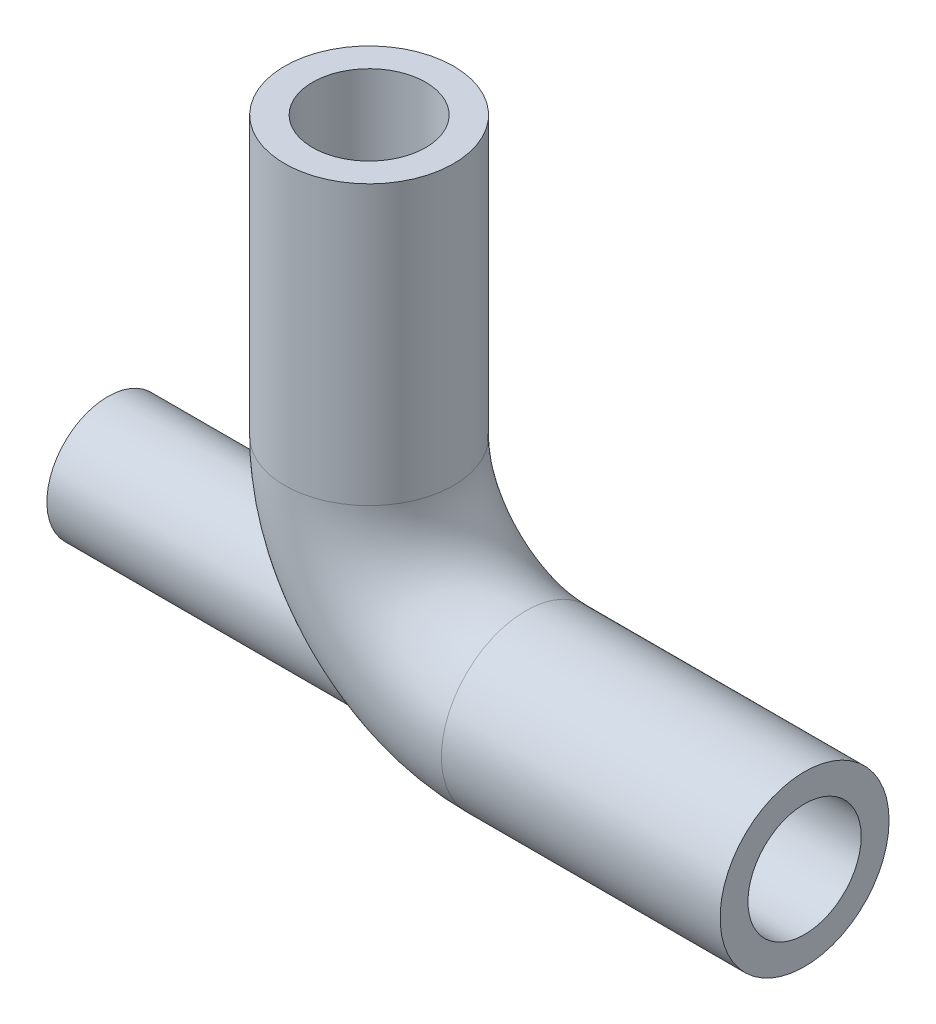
ISO-10303-21;
HEADER;
FILE_DESCRIPTION(('STEP AP214'),'2;1');
FILE_NAME('part.step','',(''),(''),'','','');
FILE_SCHEMA(('AUTOMOTIVE_DESIGN { 1 0 10303 214 1 1 1 1 }'));
ENDSEC;
DATA;
#1=APPLICATION_CONTEXT('core data for automotive mechanical design processes');
#2=APPLICATION_PROTOCOL_DEFINITION('international standard','automotive_design',2000,#1);
#3=PRODUCT_CONTEXT('',#1,'mechanical');
#4=PRODUCT('Part','Part','',(#3));
#5=PRODUCT_RELATED_PRODUCT_CATEGORY('part','',(#4));
#6=PRODUCT_DEFINITION_FORMATION('','',#4);
#7=PRODUCT_DEFINITION_CONTEXT('part definition',#1,'design');
#8=PRODUCT_DEFINITION('design','',#6,#7);
#9=PRODUCT_DEFINITION_SHAPE('','',#8);
#10=(LENGTH_UNIT() NAMED_UNIT(*) SI_UNIT(.MILLI.,.METRE.));
#11=(NAMED_UNIT(*) PLANE_ANGLE_UNIT() SI_UNIT($,.RADIAN.));
#12=(NAMED_UNIT(*) SI_UNIT($,.STERADIAN.) SOLID_ANGLE_UNIT());
#13=UNCERTAINTY_MEASURE_WITH_UNIT(LENGTH_MEASURE(1.E-05),#10,'distance_accuracy_value','');
#14=(GEOMETRIC_REPRESENTATION_CONTEXT(3) GLOBAL_UNCERTAINTY_ASSIGNED_CONTEXT((#13)) GLOBAL_UNIT_ASSIGNED_CONTEXT((#10,
#11,#12)) REPRESENTATION_CONTEXT('',''));
#15=CARTESIAN_POINT('',(0.,0.,0.));
#16=DIRECTION('',(0.,0.,1.));
#17=DIRECTION('',(1.,0.,0.));
#18=AXIS2_PLACEMENT_3D('',#15,#16,#17);
#19=CARTESIAN_POINT('',(0.,0.,0.));
#20=DIRECTION('',(0.,0.,-1.));
#21=DIRECTION('',(-1.,0.,0.));
#22=AXIS2_PLACEMENT_3D('',#19,#20,#21);
#23=TOROIDAL_SURFACE('',#22,90.,48.5);
#24=CARTESIAN_POINT('',(0.,-90.,0.));
#25=DIRECTION('',(1.,0.,0.));
#26=DIRECTION('',(0.,0.,-1.));
#27=AXIS2_PLACEMENT_3D('',#24,#25,#26);
#28=CIRCLE('',#27,48.5);
#29=CARTESIAN_POINT('',(0.,-90.,-48.5));
#30=VERTEX_POINT('',#29);
#31=EDGE_CURVE('E54',#30,#30,#28,.T.);
#32=ORIENTED_EDGE('',*,*,#31,.F.);
#33=EDGE_LOOP('',(#32));
#34=FACE_BOUND('',#33,.T.);
#35=CARTESIAN_POINT('',(-90.,0.,0.));
#36=DIRECTION('',(0.,-1.,0.));
#37=DIRECTION('',(0.,0.,-1.));
#38=AXIS2_PLACEMENT_3D('',#35,#36,#37);
#39=CIRCLE('',#38,48.5);
#40=CARTESIAN_POINT('',(-90.,0.,-48.5));
#41=VERTEX_POINT('',#40);
#42=EDGE_CURVE('E50',#41,#41,#39,.T.);
#43=ORIENTED_EDGE('',*,*,#42,.T.);
#44=EDGE_LOOP('',(#43));
#45=FACE_BOUND('',#44,.T.);
#46=CARTESIAN_POINT('',(-87.7010034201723,-87.2214538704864,-34.8895354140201));
#47=CARTESIAN_POINT('',(-87.1523949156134,-87.7153169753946,-34.928865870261));
#48=CARTESIAN_POINT('',(-86.6060258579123,-88.2124926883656,-34.9579142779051));
#49=CARTESIAN_POINT('',(-85.5188855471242,-89.2137220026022,-34.9947527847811));
#50=CARTESIAN_POINT('',(-84.9781142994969,-89.7177756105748,-35.0025428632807));
#51=CARTESIAN_POINT('',(-83.9033023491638,-90.7330117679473,-34.9960056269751));
#52=CARTESIAN_POINT('',(-83.3692624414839,-91.2441951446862,-34.9816757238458));
#53=CARTESIAN_POINT('',(-82.3092555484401,-92.2737273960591,-34.9298699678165));
#54=CARTESIAN_POINT('',(-81.7832885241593,-92.7920762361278,-34.8923942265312));
#55=CARTESIAN_POINT('',(-80.741439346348,-93.8352427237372,-34.7931756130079));
#56=CARTESIAN_POINT('',(-80.2255452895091,-94.360051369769,-34.7314634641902));
#57=CARTESIAN_POINT('',(-79.2045796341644,-95.4165627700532,-34.5824443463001));
#58=CARTESIAN_POINT('',(-78.6995082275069,-95.9482656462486,-34.4951369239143));
#59=CARTESIAN_POINT('',(-77.7018213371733,-97.0179635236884,-34.2935024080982));
#60=CARTESIAN_POINT('',(-77.2092024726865,-97.5559567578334,-34.1791827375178));
#61=CARTESIAN_POINT('',(-76.237874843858,-98.6375637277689,-33.9219912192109));
#62=CARTESIAN_POINT('',(-75.7591650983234,-99.1811770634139,-33.7791213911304));
#63=CARTESIAN_POINT('',(-74.5880806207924,-100.538575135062,-33.3864033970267));
#64=CARTESIAN_POINT('',(-73.9049798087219,-101.355216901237,-33.1183148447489));
#65=CARTESIAN_POINT('',(-72.5779868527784,-102.99363690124,-32.510438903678));
#66=CARTESIAN_POINT('',(-71.9340906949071,-103.81541459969,-32.1706588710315));
#67=CARTESIAN_POINT('',(-70.690352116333,-105.456838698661,-31.4149934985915));
#68=CARTESIAN_POINT('',(-70.0904886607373,-106.276485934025,-30.9991448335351));
#69=CARTESIAN_POINT('',(-68.9384393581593,-107.905145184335,-30.0878103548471));
#70=CARTESIAN_POINT('',(-68.3862539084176,-108.714157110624,-29.5923238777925));
#71=CARTESIAN_POINT('',(-67.3281224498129,-110.317744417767,-28.5154270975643));
#72=CARTESIAN_POINT('',(-66.8226004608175,-111.112143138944,-27.9333346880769));
#73=CARTESIAN_POINT('',(-65.8648729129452,-112.667706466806,-26.6864856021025));
#74=CARTESIAN_POINT('',(-65.4126687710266,-113.428870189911,-26.0217267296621));
#75=CARTESIAN_POINT('',(-64.5622698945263,-114.905682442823,-24.6119678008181));
#76=CARTESIAN_POINT('',(-64.1640710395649,-115.621334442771,-23.8669738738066));
#77=CARTESIAN_POINT('',(-63.4212775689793,-116.99520738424,-22.3011918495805));
#78=CARTESIAN_POINT('',(-63.076676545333,-117.653435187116,-21.4804128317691));
#79=CARTESIAN_POINT('',(-62.4772365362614,-118.828207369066,-19.8697908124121));
#80=CARTESIAN_POINT('',(-62.2166107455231,-119.352315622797,-19.087597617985));
#81=CARTESIAN_POINT('',(-61.7350861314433,-120.34033457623,-17.4745072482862));
#82=CARTESIAN_POINT('',(-61.5141840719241,-120.804250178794,-16.6436140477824));
#83=CARTESIAN_POINT('',(-61.1109266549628,-121.665809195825,-14.939477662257));
#84=CARTESIAN_POINT('',(-60.9285617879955,-122.0634689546,-14.0662449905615));
#85=CARTESIAN_POINT('',(-60.6010989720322,-122.787622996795,-12.2840087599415));
#86=CARTESIAN_POINT('',(-60.4560001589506,-123.114118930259,-11.3750060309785));
#87=CARTESIAN_POINT('',(-60.2091577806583,-123.675573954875,-9.5806587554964));
#88=CARTESIAN_POINT('',(-60.1054292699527,-123.914659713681,-8.69687508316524));
#89=CARTESIAN_POINT('',(-59.9294314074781,-124.323272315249,-6.91032301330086));
#90=CARTESIAN_POINT('',(-59.8571606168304,-124.492802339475,-6.00755548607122));
#91=CARTESIAN_POINT('',(-59.7435296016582,-124.76047256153,-4.18969490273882));
#92=CARTESIAN_POINT('',(-59.7021655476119,-124.858621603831,-3.27460338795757));
#93=CARTESIAN_POINT('',(-59.6500065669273,-124.982520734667,-1.43865841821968));
#94=CARTESIAN_POINT('',(-59.6392117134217,-125.008270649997,-0.51780494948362));
#95=CARTESIAN_POINT('',(-59.6480476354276,-124.987236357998,1.31098838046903));
#96=CARTESIAN_POINT('',(-59.6672862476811,-124.941387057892,2.21894105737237));
#97=CARTESIAN_POINT('',(-59.7356114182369,-124.779363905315,4.02740868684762));
#98=CARTESIAN_POINT('',(-59.7846975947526,-124.663190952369,4.9279237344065));
#99=CARTESIAN_POINT('',(-59.9130904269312,-124.361731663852,6.71510241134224));
#100=CARTESIAN_POINT('',(-59.9923964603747,-124.176446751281,7.60176632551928));
#101=CARTESIAN_POINT('',(-60.1818119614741,-123.738708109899,9.35499457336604));
#102=CARTESIAN_POINT('',(-60.2919215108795,-123.486254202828,10.2215588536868));
#103=CARTESIAN_POINT('',(-60.5436986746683,-122.916883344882,11.9284597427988));
#104=CARTESIAN_POINT('',(-60.6853642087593,-122.599970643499,12.7687980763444));
#105=CARTESIAN_POINT('',(-61.0011576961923,-121.905101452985,14.4175160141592));
#106=CARTESIAN_POINT('',(-61.1752855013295,-121.527145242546,15.2258957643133));
#107=CARTESIAN_POINT('',(-61.5569683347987,-120.714381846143,16.8052188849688));
#108=CARTESIAN_POINT('',(-61.7645205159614,-120.279579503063,17.5761654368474));
#109=CARTESIAN_POINT('',(-62.2140453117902,-119.35796150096,19.0757608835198));
#110=CARTESIAN_POINT('',(-62.4560181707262,-118.871145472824,19.8044094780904));
#111=CARTESIAN_POINT('',(-62.9782857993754,-117.845096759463,21.2232393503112));
#112=CARTESIAN_POINT('',(-63.2589922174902,-117.305321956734,21.9128769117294));
#113=CARTESIAN_POINT('',(-63.857245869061,-116.184479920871,23.2406511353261));
#114=CARTESIAN_POINT('',(-64.1747930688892,-115.603412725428,23.8787878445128));
#115=CARTESIAN_POINT('',(-64.8470982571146,-114.406719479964,25.100663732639));
#116=CARTESIAN_POINT('',(-65.2018555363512,-113.791094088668,25.6844039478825));
#117=CARTESIAN_POINT('',(-65.9485143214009,-112.532227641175,26.7955909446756));
#118=CARTESIAN_POINT('',(-66.3404168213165,-111.888985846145,27.323036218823));
#119=CARTESIAN_POINT('',(-67.1783764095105,-110.553769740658,28.3421570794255));
#120=CARTESIAN_POINT('',(-67.6260360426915,-109.860888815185,28.8313251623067));
#121=CARTESIAN_POINT('',(-68.559728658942,-108.460226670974,29.7476139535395));
#122=CARTESIAN_POINT('',(-69.0457618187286,-107.752445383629,30.1747343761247));
#123=CARTESIAN_POINT('',(-70.0541596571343,-106.328893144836,30.9682322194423));
#124=CARTESIAN_POINT('',(-70.5765241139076,-105.613122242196,31.3346100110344));
#125=CARTESIAN_POINT('',(-71.6550745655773,-104.179447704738,32.0089198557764));
#126=CARTESIAN_POINT('',(-72.2112647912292,-103.461543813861,32.3168445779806));
#127=CARTESIAN_POINT('',(-73.2081468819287,-102.2118448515,32.8054689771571));
#128=CARTESIAN_POINT('',(-73.6420173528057,-101.679388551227,32.9985691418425));
#129=CARTESIAN_POINT('',(-74.5254586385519,-100.617568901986,33.355373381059));
#130=CARTESIAN_POINT('',(-74.9750309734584,-100.088205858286,33.5190746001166));
#131=CARTESIAN_POINT('',(-75.8885824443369,-99.0337259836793,33.8185205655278));
#132=CARTESIAN_POINT('',(-76.3525666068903,-98.5086107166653,33.9542554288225));
#133=CARTESIAN_POINT('',(-77.2933758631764,-97.4637596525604,34.1991258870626));
#134=CARTESIAN_POINT('',(-77.7702006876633,-96.9440237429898,34.308262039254));
#135=CARTESIAN_POINT('',(-78.736888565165,-95.9088860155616,34.5016406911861));
#136=CARTESIAN_POINT('',(-79.2267891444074,-95.3935039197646,34.5858006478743));
#137=CARTESIAN_POINT('',(-80.2167635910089,-94.3692159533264,34.7300655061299));
#138=CARTESIAN_POINT('',(-80.7168374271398,-93.8603100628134,34.7901704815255));
#139=CARTESIAN_POINT('',(-81.7258292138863,-92.8492075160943,34.8875330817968));
#140=CARTESIAN_POINT('',(-82.2347466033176,-92.347010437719,34.9247921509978));
#141=CARTESIAN_POINT('',(-83.2602381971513,-91.3493190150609,34.9775479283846));
#142=CARTESIAN_POINT('',(-83.7768128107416,-90.8538250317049,34.9930434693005));
#143=CARTESIAN_POINT('',(-85.0846192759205,-89.6155586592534,35.0058445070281));
#144=CARTESIAN_POINT('',(-85.88007479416,-88.8770763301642,34.9896436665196));
#145=CARTESIAN_POINT('',(-87.4821604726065,-87.4147005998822,34.9120664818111));
#146=CARTESIAN_POINT('',(-88.2887918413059,-86.6908087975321,34.8506852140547));
#147=CARTESIAN_POINT('',(-89.9102335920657,-85.2563837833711,34.6845741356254));
#148=CARTESIAN_POINT('',(-90.7250483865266,-84.5458584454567,34.5798195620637));
#149=CARTESIAN_POINT('',(-92.3592269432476,-83.1377194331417,34.3281316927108));
#150=CARTESIAN_POINT('',(-93.1785905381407,-82.4401052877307,34.1811999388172));
#151=CARTESIAN_POINT('',(-94.8190024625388,-81.0569234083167,33.8456472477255));
#152=CARTESIAN_POINT('',(-95.6400508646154,-80.3713562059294,33.6570244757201));
#153=CARTESIAN_POINT('',(-97.2810143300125,-79.0116772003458,33.2379730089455));
#154=CARTESIAN_POINT('',(-98.1009293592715,-78.3375657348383,33.0075430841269));
#155=CARTESIAN_POINT('',(-99.7363823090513,-77.0008731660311,32.5043444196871));
#156=CARTESIAN_POINT('',(-100.551922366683,-76.3382859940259,32.2315987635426));
#157=CARTESIAN_POINT('',(-102.176221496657,-75.024337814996,31.6425015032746));
#158=CARTESIAN_POINT('',(-102.984981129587,-74.3729758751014,31.3261535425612));
#159=CARTESIAN_POINT('',(-104.329908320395,-73.2930139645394,30.759019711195));
#160=CARTESIAN_POINT('',(-104.868748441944,-72.8612085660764,30.5206136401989));
#161=CARTESIAN_POINT('',(-105.941053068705,-72.0031648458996,30.0226580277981));
#162=CARTESIAN_POINT('',(-106.474517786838,-71.5769263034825,29.7631093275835));
#163=CARTESIAN_POINT('',(-107.535096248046,-70.730347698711,29.2221295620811));
#164=CARTESIAN_POINT('',(-108.062209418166,-70.310008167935,28.940696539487));
#165=CARTESIAN_POINT('',(-109.108917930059,-69.4757700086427,28.3551703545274));
#166=CARTESIAN_POINT('',(-109.628513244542,-69.0618714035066,28.05107710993));
#167=CARTESIAN_POINT('',(-110.657840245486,-68.2420512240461,27.4200413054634));
#168=CARTESIAN_POINT('',(-111.167590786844,-67.836114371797,27.0931494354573));
#169=CARTESIAN_POINT('',(-112.17703026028,-67.0320989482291,26.4149978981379));
#170=CARTESIAN_POINT('',(-112.67671897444,-66.6340205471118,26.0637377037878));
#171=CARTESIAN_POINT('',(-113.664350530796,-65.8468407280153,25.3359846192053));
#172=CARTESIAN_POINT('',(-114.15229718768,-65.4577363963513,24.9595000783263));
#173=CARTESIAN_POINT('',(-115.114847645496,-64.6896085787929,24.1802270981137));
#174=CARTESIAN_POINT('',(-115.589452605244,-64.3105842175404,23.7774409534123));
#175=CARTESIAN_POINT('',(-116.684335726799,-63.4353821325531,22.8010208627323));
#176=CARTESIAN_POINT('',(-117.298501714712,-62.9438042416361,22.2163151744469));
#177=CARTESIAN_POINT('',(-118.493912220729,-61.9855394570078,20.9950584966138));
#178=CARTESIAN_POINT('',(-119.075157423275,-61.518852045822,20.3585085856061));
#179=CARTESIAN_POINT('',(-120.197929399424,-60.6158397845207,19.0319231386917));
#180=CARTESIAN_POINT('',(-120.739491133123,-60.1794882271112,18.3419358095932));
#181=CARTESIAN_POINT('',(-121.516507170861,-59.5523267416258,17.2659052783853));
#182=CARTESIAN_POINT('',(-121.769606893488,-59.3478483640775,16.9004161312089));
#183=CARTESIAN_POINT('',(-122.263106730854,-58.9487971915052,16.1555371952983));
#184=CARTESIAN_POINT('',(-122.503503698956,-58.7542268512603,15.7761440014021));
#185=CARTESIAN_POINT('',(-123.093370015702,-58.2763863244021,14.8001140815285));
#186=CARTESIAN_POINT('',(-123.433621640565,-58.0003556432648,14.1942745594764));
#187=CARTESIAN_POINT('',(-124.077353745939,-57.4774715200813,12.9514288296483));
#188=CARTESIAN_POINT('',(-124.380843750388,-57.2306105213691,12.3144307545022));
#189=CARTESIAN_POINT('',(-124.94652259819,-56.7699623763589,11.0109979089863));
#190=CARTESIAN_POINT('',(-125.20872683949,-56.556162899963,10.3445742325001));
#191=CARTESIAN_POINT('',(-125.687355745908,-56.1655141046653,8.98486587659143));
#192=CARTESIAN_POINT('',(-125.903779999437,-55.9886651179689,8.29158095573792));
#193=CARTESIAN_POINT('',(-126.288366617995,-55.6741632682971,6.87519274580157));
#194=CARTESIAN_POINT('',(-126.45602678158,-55.5369183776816,6.15186122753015));
#195=CARTESIAN_POINT('',(-126.736259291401,-55.3074014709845,4.68750696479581));
#196=CARTESIAN_POINT('',(-126.848831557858,-55.2151295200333,3.94648419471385));
#197=CARTESIAN_POINT('',(-127.015954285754,-55.078108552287,2.454089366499));
#198=CARTESIAN_POINT('',(-127.070547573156,-55.033324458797,1.70272536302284));
#199=CARTESIAN_POINT('',(-127.120373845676,-54.9924519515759,0.196756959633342));
#200=CARTESIAN_POINT('',(-127.115615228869,-54.9963566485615,-0.557846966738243));
#201=CARTESIAN_POINT('',(-127.052009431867,-55.0485298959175,-1.95101446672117));
#202=CARTESIAN_POINT('',(-127.001271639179,-55.0901470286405,-2.59022307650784));
#203=CARTESIAN_POINT('',(-126.857858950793,-55.2077276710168,-3.86064730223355));
#204=CARTESIAN_POINT('',(-126.765189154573,-55.28368700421,-4.49186388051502));
#205=CARTESIAN_POINT('',(-126.539614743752,-55.468469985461,-5.74220854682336));
#206=CARTESIAN_POINT('',(-126.406704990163,-55.5772978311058,-6.36133508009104));
#207=CARTESIAN_POINT('',(-126.102942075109,-55.8258257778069,-7.58386299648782));
#208=CARTESIAN_POINT('',(-125.932086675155,-55.9655277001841,-8.18726344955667));
#209=CARTESIAN_POINT('',(-125.551985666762,-56.2760324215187,-9.38526996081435));
#210=CARTESIAN_POINT('',(-125.342150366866,-56.4473125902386,-9.97956420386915));
#211=CARTESIAN_POINT('',(-124.889075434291,-56.8167446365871,-11.1465793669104));
#212=CARTESIAN_POINT('',(-124.645836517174,-57.0148959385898,-11.7193007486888));
#213=CARTESIAN_POINT('',(-124.128987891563,-57.4354511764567,-12.841705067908));
#214=CARTESIAN_POINT('',(-123.855374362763,-57.6578581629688,-13.3913850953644));
#215=CARTESIAN_POINT('',(-123.280764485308,-58.1243601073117,-14.4667646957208));
#216=CARTESIAN_POINT('',(-122.97976173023,-58.3684601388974,-14.9924586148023));
#217=CARTESIAN_POINT('',(-122.157824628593,-59.0341741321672,-16.3395896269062));
#218=CARTESIAN_POINT('',(-121.616775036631,-59.4715763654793,-17.1410657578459));
#219=CARTESIAN_POINT('',(-120.480901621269,-60.3879455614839,-18.6796391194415));
#220=CARTESIAN_POINT('',(-119.886050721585,-60.8669334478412,-19.4167035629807));
#221=CARTESIAN_POINT('',(-118.650508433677,-61.8599029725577,-20.8298458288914));
#222=CARTESIAN_POINT('',(-118.009706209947,-62.373969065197,-21.5057666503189));
#223=CARTESIAN_POINT('',(-116.691471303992,-63.4297284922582,-22.7972896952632));
#224=CARTESIAN_POINT('',(-116.014040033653,-63.9714207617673,-23.4128942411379));
#225=CARTESIAN_POINT('',(-114.780865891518,-64.9562546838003,-24.4582762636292));
#226=CARTESIAN_POINT('',(-114.230983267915,-65.3949831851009,-24.8992154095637));
#227=CARTESIAN_POINT('',(-113.115393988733,-66.2844698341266,-25.7478451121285));
#228=CARTESIAN_POINT('',(-112.54968545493,-66.7352294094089,-26.1555316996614));
#229=CARTESIAN_POINT('',(-111.404551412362,-67.6474062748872,-26.9392521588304));
#230=CARTESIAN_POINT('',(-110.825119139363,-68.1088288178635,-27.3152699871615));
#231=CARTESIAN_POINT('',(-109.654860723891,-69.0408790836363,-28.036807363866));
#232=CARTESIAN_POINT('',(-109.064034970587,-69.5115064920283,-28.3823279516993));
#233=CARTESIAN_POINT('',(-107.872329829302,-70.4613877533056,-29.0444149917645));
#234=CARTESIAN_POINT('',(-107.271443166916,-70.9406478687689,-29.3609593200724));
#235=CARTESIAN_POINT('',(-106.061678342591,-71.9067352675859,-29.9659575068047));
#236=CARTESIAN_POINT('',(-105.452800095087,-72.3935626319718,-30.2544110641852));
#237=CARTESIAN_POINT('',(-104.22870707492,-73.3741437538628,-30.80416797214));
#238=CARTESIAN_POINT('',(-103.61349395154,-73.8678957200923,-31.0654782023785));
#239=CARTESIAN_POINT('',(-102.377969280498,-74.8621155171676,-31.5618944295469));
#240=CARTESIAN_POINT('',(-101.757657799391,-75.3625832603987,-31.7970007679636));
#241=CARTESIAN_POINT('',(-100.578133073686,-76.3175374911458,-32.2185265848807));
#242=CARTESIAN_POINT('',(-100.019293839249,-76.771376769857,-32.4074665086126));
#243=CARTESIAN_POINT('',(-98.8994547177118,-77.6843161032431,-32.765291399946));
#244=CARTESIAN_POINT('',(-98.3384547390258,-78.1434163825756,-32.9341755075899));
#245=CARTESIAN_POINT('',(-97.2152492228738,-79.066888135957,-33.2521507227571));
#246=CARTESIAN_POINT('',(-96.6530437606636,-79.5312592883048,-33.4012430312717));
#247=CARTESIAN_POINT('',(-95.5282555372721,-80.4654570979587,-33.6798172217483));
#248=CARTESIAN_POINT('',(-94.9656727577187,-80.9352840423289,-33.8092980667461));
#249=CARTESIAN_POINT('',(-93.8411721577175,-81.8804707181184,-34.0486544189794));
#250=CARTESIAN_POINT('',(-93.2792542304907,-82.355829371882,-34.15853367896));
#251=CARTESIAN_POINT('',(-92.1569348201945,-83.312381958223,-34.3586162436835));
#252=CARTESIAN_POINT('',(-91.5965332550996,-83.7935755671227,-34.448820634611));
#253=CARTESIAN_POINT('',(-90.4781514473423,-84.7621234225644,-34.609328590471));
#254=CARTESIAN_POINT('',(-89.9201713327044,-85.2494779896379,-34.679631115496));
#255=CARTESIAN_POINT('',(-88.8077057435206,-86.2305877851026,-34.7999394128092));
#256=CARTESIAN_POINT('',(-88.2532200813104,-86.7243426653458,-34.8499462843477));
#257=CARTESIAN_POINT('',(-87.7010034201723,-87.2214538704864,-34.8895354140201));
#258=B_SPLINE_CURVE_WITH_KNOTS('',3,(#46,#47,#48,#49,#50,#51,#52,#53,#54,#55,#56,#57,#58,#59,
#60,#61,#62,#63,#64,#65,#66,#67,#68,#69,#70,#71,#72,#73,#74,#75,#76,#77,#78,#79,#80,#81,#82,#83,
#84,#85,#86,#87,#88,#89,#90,#91,#92,#93,#94,#95,#96,#97,#98,#99,#100,#101,#102,#103,#104,#105,
#106,#107,#108,#109,#110,#111,#112,#113,#114,#115,#116,#117,#118,#119,#120,#121,#122,#123,#124,
#125,#126,#127,#128,#129,#130,#131,#132,#133,#134,#135,#136,#137,#138,#139,#140,#141,#142,#143,
#144,#145,#146,#147,#148,#149,#150,#151,#152,#153,#154,#155,#156,#157,#158,#159,#160,#161,#162,
#163,#164,#165,#166,#167,#168,#169,#170,#171,#172,#173,#174,#175,#176,#177,#178,#179,#180,#181,
#182,#183,#184,#185,#186,#187,#188,#189,#190,#191,#192,#193,#194,#195,#196,#197,#198,#199,#200,
#201,#202,#203,#204,#205,#206,#207,#208,#209,#210,#211,#212,#213,#214,#215,#216,#217,#218,#219,
#220,#221,#222,#223,#224,#225,#226,#227,#228,#229,#230,#231,#232,#233,#234,#235,#236,#237,#238,
#239,#240,#241,#242,#243,#244,#245,#246,#247,#248,#249,#250,#251,#252,#253,#254,#255,#256,#257),
.UNSPECIFIED.,.T.,.F.,(4,2,2,2,2,2,2,2,2,2,2,2,2,2,2,2,2,2,2,2,2,2,2,2,2,2,2,2,2,2,2,2,2,2,2,2,
2,2,2,2,2,2,2,2,2,2,2,2,2,2,2,2,2,2,2,2,2,2,2,2,2,2,2,2,2,2,2,2,2,2,2,2,2,2,2,2,2,2,2,2,2,2,2,2,
2,2,2,2,2,2,2,2,2,2,2,2,2,2,2,2,2,2,2,2,2,4),(0.,2.21752137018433,4.43504490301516,
6.65282793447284,8.87060027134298,11.0855702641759,13.3005794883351,15.5149807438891,
17.7292254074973,21.0199956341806,24.3104283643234,27.5992788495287,30.8881567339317,
34.2044623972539,37.5208561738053,40.8369967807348,44.1527406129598,47.0798501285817,
50.00672107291,52.9328689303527,55.858948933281,58.6198610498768,61.3806468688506,
64.1410905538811,66.9015408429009,69.6262468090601,72.3509179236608,75.0755329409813,
77.8001551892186,80.5245978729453,83.2490281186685,85.9732264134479,88.6974440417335,
91.4532354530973,94.2090243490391,96.9647607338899,99.7205708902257,102.594682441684,
105.468807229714,108.34291446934,111.217381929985,113.357031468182,115.496888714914,
117.637500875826,119.778068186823,121.925632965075,124.073191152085,126.220613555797,
128.368151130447,131.623472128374,134.879147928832,138.136685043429,141.394103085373,
144.651664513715,147.909321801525,151.165208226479,154.420822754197,156.612039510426,
158.803169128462,160.994494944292,163.185828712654,165.372436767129,167.559092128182,
169.745027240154,171.930771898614,174.869148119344,177.807463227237,180.743157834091,
182.210782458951,183.678768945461,185.919708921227,188.160067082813,190.399587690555,
192.639128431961,194.900976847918,197.162828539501,199.423008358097,201.682868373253,
203.60826717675,205.533431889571,207.458842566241,209.384366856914,211.34182512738,
213.299241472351,215.256904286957,217.215026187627,220.393994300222,223.574571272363,
226.763096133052,229.951498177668,232.441280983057,234.931360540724,237.4226940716,
239.913942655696,242.407077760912,244.900239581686,247.392767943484,249.885263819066,
252.117846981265,254.350525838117,256.583069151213,258.815730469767,261.047963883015,
263.280074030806,265.512300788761,267.744406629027),.UNSPECIFIED.);
#259=CARTESIAN_POINT('',(-87.7010034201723,-87.2214538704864,-34.8895354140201));
#260=VERTEX_POINT('',#259);
#261=EDGE_CURVE('E10',#260,#260,#258,.T.);
#262=ORIENTED_EDGE('',*,*,#261,.F.);
#263=EDGE_LOOP('',(#262));
#264=FACE_BOUND('',#263,.T.);
#265=ADVANCED_FACE('F36',(#34,#45,#264),#23,.T.);
#266=CARTESIAN_POINT('',(-90.,0.,0.));
#267=DIRECTION('',(0.,1.,0.));
#268=DIRECTION('',(0.,0.,1.));
#269=AXIS2_PLACEMENT_3D('',#266,#267,#268);
#270=CYLINDRICAL_SURFACE('',#269,48.5);
#271=ORIENTED_EDGE('',*,*,#42,.F.);
#272=EDGE_LOOP('',(#271));
#273=FACE_BOUND('',#272,.T.);
#274=CARTESIAN_POINT('',(-90.,160.,0.));
#275=DIRECTION('',(0.,-1.,0.));
#276=DIRECTION('',(0.,0.,-1.));
#277=AXIS2_PLACEMENT_3D('',#274,#275,#276);
#278=CIRCLE('',#277,48.5);
#279=CARTESIAN_POINT('',(-90.,160.,-48.5));
#280=VERTEX_POINT('',#279);
#281=EDGE_CURVE('E46',#280,#280,#278,.T.);
#282=ORIENTED_EDGE('',*,*,#281,.T.);
#283=EDGE_LOOP('',(#282));
#284=FACE_BOUND('',#283,.T.);
#285=ADVANCED_FACE('F38',(#273,#284),#270,.T.);
#286=CARTESIAN_POINT('',(0.,-90.,0.));
#287=DIRECTION('',(1.,0.,0.));
#288=DIRECTION('',(0.,0.,-1.));
#289=AXIS2_PLACEMENT_3D('',#286,#287,#288);
#290=CYLINDRICAL_SURFACE('',#289,48.5);
#291=ORIENTED_EDGE('',*,*,#31,.T.);
#292=EDGE_LOOP('',(#291));
#293=FACE_BOUND('',#292,.T.);
#294=CARTESIAN_POINT('',(160.,-90.,0.));
#295=DIRECTION('',(1.,0.,0.));
#296=DIRECTION('',(0.,0.,-1.));
#297=AXIS2_PLACEMENT_3D('',#294,#295,#296);
#298=CIRCLE('',#297,48.5);
#299=CARTESIAN_POINT('',(160.,-90.,-48.5));
#300=VERTEX_POINT('',#299);
#301=EDGE_CURVE('E57',#300,#300,#298,.T.);
#302=ORIENTED_EDGE('',*,*,#301,.F.);
#303=EDGE_LOOP('',(#302));
#304=FACE_BOUND('',#303,.T.);
#305=ADVANCED_FACE('F120',(#293,#304),#290,.T.);
#306=CARTESIAN_POINT('',(-90.,160.,0.));
#307=DIRECTION('',(0.,-1.,0.));
#308=DIRECTION('',(0.,0.,-1.));
#309=AXIS2_PLACEMENT_3D('',#306,#307,#308);
#310=PLANE('',#309);
#311=CARTESIAN_POINT('',(-90.,160.,0.));
#312=DIRECTION('',(0.,-1.,0.));
#313=DIRECTION('',(1.,0.,0.));
#314=AXIS2_PLACEMENT_3D('',#311,#312,#313);
#315=CIRCLE('',#314,32.5);
#316=CARTESIAN_POINT('',(-57.5,160.,0.));
#317=VERTEX_POINT('',#316);
#318=EDGE_CURVE('E60',#317,#317,#315,.T.);
#319=ORIENTED_EDGE('',*,*,#318,.T.);
#320=EDGE_LOOP('',(#319));
#321=FACE_BOUND('',#320,.T.);
#322=ORIENTED_EDGE('',*,*,#281,.F.);
#323=EDGE_LOOP('',(#322));
#324=FACE_BOUND('',#323,.T.);
#325=ADVANCED_FACE('F111',(#321,#324),#310,.F.);
#326=CARTESIAN_POINT('',(160.,-90.,0.));
#327=DIRECTION('',(1.,0.,0.));
#328=DIRECTION('',(0.,0.,-1.));
#329=AXIS2_PLACEMENT_3D('',#326,#327,#328);
#330=PLANE('',#329);
#331=CARTESIAN_POINT('',(160.,-90.,0.));
#332=DIRECTION('',(1.,0.,0.));
#333=DIRECTION('',(0.,0.,-1.));
#334=AXIS2_PLACEMENT_3D('',#331,#332,#333);
#335=CIRCLE('',#334,32.5);
#336=CARTESIAN_POINT('',(160.,-90.,-32.5));
#337=VERTEX_POINT('',#336);
#338=EDGE_CURVE('E63',#337,#337,#335,.T.);
#339=ORIENTED_EDGE('',*,*,#338,.F.);
#340=EDGE_LOOP('',(#339));
#341=FACE_BOUND('',#340,.T.);
#342=ORIENTED_EDGE('',*,*,#301,.T.);
#343=EDGE_LOOP('',(#342));
#344=FACE_BOUND('',#343,.T.);
#345=ADVANCED_FACE('F104',(#341,#344),#330,.T.);
#346=CARTESIAN_POINT('',(-90.,0.,0.));
#347=DIRECTION('',(0.,1.,0.));
#348=DIRECTION('',(0.,0.,1.));
#349=AXIS2_PLACEMENT_3D('',#346,#347,#348);
#350=CYLINDRICAL_SURFACE('',#349,32.5);
#351=CARTESIAN_POINT('',(-90.,0.,0.));
#352=DIRECTION('',(0.,-1.,0.));
#353=DIRECTION('',(1.,0.,0.));
#354=AXIS2_PLACEMENT_3D('',#351,#352,#353);
#355=CIRCLE('',#354,32.5);
#356=CARTESIAN_POINT('',(-57.5,0.,0.));
#357=VERTEX_POINT('',#356);
#358=EDGE_CURVE('E70',#357,#357,#355,.T.);
#359=ORIENTED_EDGE('',*,*,#358,.T.);
#360=EDGE_LOOP('',(#359));
#361=FACE_BOUND('',#360,.T.);
#362=ORIENTED_EDGE('',*,*,#318,.F.);
#363=EDGE_LOOP('',(#362));
#364=FACE_BOUND('',#363,.T.);
#365=ADVANCED_FACE('F102',(#361,#364),#350,.F.);
#366=CARTESIAN_POINT('',(0.,0.,0.));
#367=DIRECTION('',(0.,0.,-1.));
#368=DIRECTION('',(-1.,0.,0.));
#369=AXIS2_PLACEMENT_3D('',#366,#367,#368);
#370=TOROIDAL_SURFACE('',#369,90.,32.5);
#371=CARTESIAN_POINT('',(-101.505120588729,-63.1996513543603,-13.4811465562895));
#372=CARTESIAN_POINT('',(-101.833819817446,-63.0051799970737,-13.0945308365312));
#373=CARTESIAN_POINT('',(-102.152712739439,-62.8157413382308,-12.6971120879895));
#374=CARTESIAN_POINT('',(-102.768207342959,-62.4488023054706,-11.8799059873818));
#375=CARTESIAN_POINT('',(-103.064806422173,-62.2713033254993,-11.4601160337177));
#376=CARTESIAN_POINT('',(-103.63251677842,-61.9304503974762,-10.5978918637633));
#377=CARTESIAN_POINT('',(-103.903620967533,-61.7671003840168,-10.155451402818));
#378=CARTESIAN_POINT('',(-104.416569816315,-61.4571315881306,-9.24846997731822));
#379=CARTESIAN_POINT('',(-104.658426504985,-61.3105059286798,-8.78393820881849));
#380=CARTESIAN_POINT('',(-105.111701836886,-61.0350183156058,-7.82814941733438));
#381=CARTESIAN_POINT('',(-105.322743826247,-60.9063768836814,-7.33664889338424));
#382=CARTESIAN_POINT('',(-105.706937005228,-60.6717037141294,-6.33373271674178));
#383=CARTESIAN_POINT('',(-105.880088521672,-60.5656717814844,-5.82231723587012));
#384=CARTESIAN_POINT('',(-106.184326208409,-60.3790737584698,-4.7831964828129));
#385=CARTESIAN_POINT('',(-106.315462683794,-60.2984772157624,-4.2555115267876));
#386=CARTESIAN_POINT('',(-106.532479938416,-60.1649610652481,-3.18745956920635));
#387=CARTESIAN_POINT('',(-106.618367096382,-60.1120375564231,-2.64709436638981));
#388=CARTESIAN_POINT('',(-106.736794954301,-60.0390285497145,-1.60820079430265));
#389=CARTESIAN_POINT('',(-106.773465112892,-60.0164015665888,-1.11031939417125));
#390=CARTESIAN_POINT('',(-106.806424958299,-59.9960648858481,-0.112717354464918));
#391=CARTESIAN_POINT('',(-106.802717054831,-59.9983537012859,0.387003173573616));
#392=CARTESIAN_POINT('',(-106.755017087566,-60.027782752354,1.38378516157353));
#393=CARTESIAN_POINT('',(-106.711022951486,-60.0549242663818,1.88084648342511));
#394=CARTESIAN_POINT('',(-106.583858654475,-60.1332984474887,2.86797419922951));
#395=CARTESIAN_POINT('',(-106.500689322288,-60.1845306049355,3.3580407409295));
#396=CARTESIAN_POINT('',(-106.307741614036,-60.303214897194,4.27701708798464));
#397=CARTESIAN_POINT('',(-106.201621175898,-60.3684315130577,4.70699494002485));
#398=CARTESIAN_POINT('',(-105.961339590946,-60.5158609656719,5.55619775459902));
#399=CARTESIAN_POINT('',(-105.827168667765,-60.5980797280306,5.97541891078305));
#400=CARTESIAN_POINT('',(-105.532949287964,-60.7780305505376,6.80110463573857));
#401=CARTESIAN_POINT('',(-105.372906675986,-60.8757591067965,7.20757206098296));
#402=CARTESIAN_POINT('',(-105.029118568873,-61.0852304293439,8.00667338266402));
#403=CARTESIAN_POINT('',(-104.845367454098,-61.1969765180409,8.39930397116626));
#404=CARTESIAN_POINT('',(-104.353423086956,-61.4954132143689,9.37379882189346));
#405=CARTESIAN_POINT('',(-104.030825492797,-61.6904755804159,9.94587916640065));
#406=CARTESIAN_POINT('',(-103.342805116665,-62.1046762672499,11.0544790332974));
#407=CARTESIAN_POINT('',(-102.977363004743,-62.3238254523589,11.5909823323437));
#408=CARTESIAN_POINT('',(-102.209444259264,-62.7821207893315,12.629729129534));
#409=CARTESIAN_POINT('',(-101.806882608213,-63.0213127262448,13.1318891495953));
#410=CARTESIAN_POINT('',(-100.971149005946,-63.5153118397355,14.1016836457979));
#411=CARTESIAN_POINT('',(-100.537977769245,-63.7701186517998,14.569318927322));
#412=CARTESIAN_POINT('',(-99.7287871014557,-64.2435035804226,15.3877495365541));
#413=CARTESIAN_POINT('',(-99.3571262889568,-64.4600033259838,15.7440972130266));
#414=CARTESIAN_POINT('',(-98.5987371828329,-64.8997404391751,16.4360899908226));
#415=CARTESIAN_POINT('',(-98.2120068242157,-65.1229787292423,16.771732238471));
#416=CARTESIAN_POINT('',(-97.4251840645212,-65.5750021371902,17.4234561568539));
#417=CARTESIAN_POINT('',(-97.0250851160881,-65.8037899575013,17.7395280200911));
#418=CARTESIAN_POINT('',(-96.2132556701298,-66.2657418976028,18.3529950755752));
#419=CARTESIAN_POINT('',(-95.8015245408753,-66.4989062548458,18.6503892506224));
#420=CARTESIAN_POINT('',(-94.9675176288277,-66.9688403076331,19.2276966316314));
#421=CARTESIAN_POINT('',(-94.5452350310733,-67.2056122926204,19.5075981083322));
#422=CARTESIAN_POINT('',(-93.6915590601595,-67.6818245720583,20.0506709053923));
#423=CARTESIAN_POINT('',(-93.2601657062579,-67.9212648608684,20.3138422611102));
#424=CARTESIAN_POINT('',(-91.9540273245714,-68.6424686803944,21.0795643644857));
#425=CARTESIAN_POINT('',(-91.0670413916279,-69.1272745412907,21.5585164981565));
#426=CARTESIAN_POINT('',(-89.2921559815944,-70.0871587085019,22.4475955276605));
#427=CARTESIAN_POINT('',(-88.4049628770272,-70.5621343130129,22.8592618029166));
#428=CARTESIAN_POINT('',(-86.610335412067,-71.5130928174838,23.6349486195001));
#429=CARTESIAN_POINT('',(-85.7028970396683,-71.9890758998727,23.9989596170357));
#430=CARTESIAN_POINT('',(-83.8706819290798,-72.9404644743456,24.6843317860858));
#431=CARTESIAN_POINT('',(-82.9458900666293,-73.4158690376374,25.0056535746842));
#432=CARTESIAN_POINT('',(-81.082681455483,-74.3643751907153,25.6094364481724));
#433=CARTESIAN_POINT('',(-80.1442655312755,-74.8374769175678,25.8918998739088));
#434=CARTESIAN_POINT('',(-78.2500267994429,-75.7837304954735,26.4233613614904));
#435=CARTESIAN_POINT('',(-77.2941307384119,-76.2568629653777,26.6721316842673));
#436=CARTESIAN_POINT('',(-75.3729249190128,-77.1998697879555,27.137300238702));
#437=CARTESIAN_POINT('',(-74.4076150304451,-77.6697440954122,27.3536980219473));
#438=CARTESIAN_POINT('',(-72.4702044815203,-78.6060981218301,27.7567759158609));
#439=CARTESIAN_POINT('',(-71.4981099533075,-79.072580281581,27.9434799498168));
#440=CARTESIAN_POINT('',(-69.5480580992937,-80.0032765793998,28.2897863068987));
#441=CARTESIAN_POINT('',(-68.5701007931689,-80.4674907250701,28.4493887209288));
#442=CARTESIAN_POINT('',(-66.4416842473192,-81.4745415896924,28.7687626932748));
#443=CARTESIAN_POINT('',(-65.2904363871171,-82.0171928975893,28.9238584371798));
#444=CARTESIAN_POINT('',(-62.9848954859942,-83.1042625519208,29.2021160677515));
#445=CARTESIAN_POINT('',(-61.8306023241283,-83.6486809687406,29.3252766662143));
#446=CARTESIAN_POINT('',(-59.519839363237,-84.7448917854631,29.5414444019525));
#447=CARTESIAN_POINT('',(-58.3633697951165,-85.2966966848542,29.634391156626));
#448=CARTESIAN_POINT('',(-56.6317856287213,-86.1339007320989,29.7511740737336));
#449=CARTESIAN_POINT('',(-56.0551187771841,-86.4145476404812,29.7863285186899));
#450=CARTESIAN_POINT('',(-54.9034291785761,-86.9800320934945,29.8489665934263));
#451=CARTESIAN_POINT('',(-54.3284064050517,-87.2648695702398,29.8764503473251));
#452=CARTESIAN_POINT('',(-53.186436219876,-87.8369976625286,29.9232846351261));
#453=CARTESIAN_POINT('',(-52.6194655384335,-88.1242353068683,29.9427137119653));
#454=CARTESIAN_POINT('',(-51.4886227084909,-88.7051960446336,29.9734568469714));
#455=CARTESIAN_POINT('',(-50.9247505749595,-88.9989191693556,29.9847708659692));
#456=CARTESIAN_POINT('',(-49.8008785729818,-89.5943697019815,29.9987365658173));
#457=CARTESIAN_POINT('',(-49.2408801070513,-89.8960998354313,30.0013852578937));
#458=CARTESIAN_POINT('',(-48.1261186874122,-90.5090369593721,29.9972469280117));
#459=CARTESIAN_POINT('',(-47.5713556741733,-90.8202438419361,29.9904600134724));
#460=CARTESIAN_POINT('',(-46.4702891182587,-91.4527912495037,29.9664687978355));
#461=CARTESIAN_POINT('',(-45.9239636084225,-91.7740947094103,29.9492991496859));
#462=CARTESIAN_POINT('',(-44.8395356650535,-92.429606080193,29.9032605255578));
#463=CARTESIAN_POINT('',(-44.3014336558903,-92.7638146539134,29.8743909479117));
#464=CARTESIAN_POINT('',(-43.2358806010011,-93.4466402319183,29.8033289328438));
#465=CARTESIAN_POINT('',(-42.7084218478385,-93.795246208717,29.7611465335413));
#466=CARTESIAN_POINT('',(-41.6661570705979,-94.5087105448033,29.6614443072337));
#467=CARTESIAN_POINT('',(-41.1513486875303,-94.8735658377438,29.6039273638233));
#468=CARTESIAN_POINT('',(-40.3153672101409,-95.4894972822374,29.4945059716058));
#469=CARTESIAN_POINT('',(-39.9897549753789,-95.7354729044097,29.447738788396));
#470=CARTESIAN_POINT('',(-39.3457517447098,-96.2350862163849,29.3460169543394));
#471=CARTESIAN_POINT('',(-39.0273607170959,-96.488723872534,29.2910623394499));
#472=CARTESIAN_POINT('',(-38.3985667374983,-97.0038577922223,29.1721760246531));
#473=CARTESIAN_POINT('',(-38.0881656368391,-97.265355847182,29.108242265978));
#474=CARTESIAN_POINT('',(-37.4763056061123,-97.7960992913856,28.9706055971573));
#475=CARTESIAN_POINT('',(-37.1748466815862,-98.0653446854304,28.8969026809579));
#476=CARTESIAN_POINT('',(-36.2865758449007,-98.8831915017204,28.6602620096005));
#477=CARTESIAN_POINT('',(-35.7142453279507,-99.4432285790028,28.4814952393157));
#478=CARTESIAN_POINT('',(-34.6149193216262,-100.589603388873,28.0754286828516));
#479=CARTESIAN_POINT('',(-34.0879204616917,-101.175939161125,27.8481325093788));
#480=CARTESIAN_POINT('',(-33.0788570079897,-102.373592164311,27.3371880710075));
#481=CARTESIAN_POINT('',(-32.5972799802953,-102.98509706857,27.0530125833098));
#482=CARTESIAN_POINT('',(-31.6871829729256,-104.217584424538,26.4260872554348));
#483=CARTESIAN_POINT('',(-31.2586655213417,-104.838567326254,26.0833346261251));
#484=CARTESIAN_POINT('',(-30.4535249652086,-106.079687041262,25.3371043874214));
#485=CARTESIAN_POINT('',(-30.0769984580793,-106.699820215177,24.9335165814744));
#486=CARTESIAN_POINT('',(-29.3741312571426,-107.92657244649,24.0666153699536));
#487=CARTESIAN_POINT('',(-29.0477887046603,-108.533192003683,23.6033041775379));
#488=CARTESIAN_POINT('',(-28.4753248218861,-109.655568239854,22.6744009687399));
#489=CARTESIAN_POINT('',(-28.2243114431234,-110.173886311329,22.2148898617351));
#490=CARTESIAN_POINT('',(-27.7555290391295,-111.184931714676,21.2528932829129));
#491=CARTESIAN_POINT('',(-27.5377565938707,-111.677661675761,20.7504122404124));
#492=CARTESIAN_POINT('',(-27.1323540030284,-112.631689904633,19.7055065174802));
#493=CARTESIAN_POINT('',(-26.9447119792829,-113.093000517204,19.1630977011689));
#494=CARTESIAN_POINT('',(-26.5964972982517,-113.979579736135,18.0413669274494));
#495=CARTESIAN_POINT('',(-26.4359262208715,-114.404846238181,17.4620428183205));
#496=CARTESIAN_POINT('',(-26.1316210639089,-115.235952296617,16.2394775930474));
#497=CARTESIAN_POINT('',(-25.9891694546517,-115.639683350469,15.5944826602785));
#498=CARTESIAN_POINT('',(-25.7286232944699,-116.398744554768,14.2719202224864));
#499=CARTESIAN_POINT('',(-25.6105293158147,-116.754073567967,13.5943519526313));
#500=CARTESIAN_POINT('',(-25.3964729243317,-117.41311574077,12.2109886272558));
#501=CARTESIAN_POINT('',(-25.3005160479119,-117.716815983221,11.5051865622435));
#502=CARTESIAN_POINT('',(-25.1289916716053,-118.269820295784,10.070182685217));
#503=CARTESIAN_POINT('',(-25.053424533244,-118.519123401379,9.34098045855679));
#504=CARTESIAN_POINT('',(-24.9188153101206,-118.969503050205,7.83629111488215));
#505=CARTESIAN_POINT('',(-24.8604978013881,-119.168424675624,7.06009323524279));
#506=CARTESIAN_POINT('',(-24.763169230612,-119.50369267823,5.4930993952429));
#507=CARTESIAN_POINT('',(-24.7241586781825,-119.640037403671,4.70230305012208));
#508=CARTESIAN_POINT('',(-24.6646864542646,-119.848980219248,3.11158089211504));
#509=CARTESIAN_POINT('',(-24.6442261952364,-119.921573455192,2.31165438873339));
#510=CARTESIAN_POINT('',(-24.6214652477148,-120.002377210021,0.708302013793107));
#511=CARTESIAN_POINT('',(-24.6191645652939,-120.010587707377,-0.0951238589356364));
#512=CARTESIAN_POINT('',(-24.6327483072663,-119.962306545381,-1.7082129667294));
#513=CARTESIAN_POINT('',(-24.6488213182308,-119.905143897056,-2.51785462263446));
#514=CARTESIAN_POINT('',(-24.6997756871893,-119.725517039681,-4.1292707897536));
#515=CARTESIAN_POINT('',(-24.7346572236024,-119.60305221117,-4.93104522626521));
#516=CARTESIAN_POINT('',(-24.8239195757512,-119.293891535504,-6.52102957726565));
#517=CARTESIAN_POINT('',(-24.8783007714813,-119.107194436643,-7.30923922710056));
#518=CARTESIAN_POINT('',(-25.007647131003,-118.671240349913,-8.86643614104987));
#519=CARTESIAN_POINT('',(-25.0826122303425,-118.42198355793,-9.63542346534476));
#520=CARTESIAN_POINT('',(-25.2546020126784,-117.863323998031,-11.1483238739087));
#521=CARTESIAN_POINT('',(-25.3516174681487,-117.55394639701,-11.8922472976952));
#522=CARTESIAN_POINT('',(-25.5697001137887,-116.877945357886,-13.3499625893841));
#523=CARTESIAN_POINT('',(-25.6907673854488,-116.511321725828,-14.0637543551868));
#524=CARTESIAN_POINT('',(-25.9594381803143,-115.724521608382,-15.4560131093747));
#525=CARTESIAN_POINT('',(-26.1070429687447,-115.30434256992,-16.1344784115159));
#526=CARTESIAN_POINT('',(-26.4317963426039,-114.414995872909,-17.4510450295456));
#527=CARTESIAN_POINT('',(-26.6089445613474,-113.945828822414,-18.0891468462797));
#528=CARTESIAN_POINT('',(-26.9938776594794,-112.970223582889,-19.3125125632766));
#529=CARTESIAN_POINT('',(-27.2012471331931,-112.464331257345,-19.8983422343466));
#530=CARTESIAN_POINT('',(-27.6520895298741,-111.416516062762,-21.0219612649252));
#531=CARTESIAN_POINT('',(-27.8955622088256,-110.87459343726,-21.559750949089));
#532=CARTESIAN_POINT('',(-28.4226135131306,-109.762446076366,-22.5835500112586));
#533=CARTESIAN_POINT('',(-28.7061777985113,-109.192231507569,-23.0695777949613));
#534=CARTESIAN_POINT('',(-29.3174657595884,-108.032080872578,-23.9873087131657));
#535=CARTESIAN_POINT('',(-29.6451869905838,-107.442145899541,-24.4190148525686));
#536=CARTESIAN_POINT('',(-30.331885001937,-106.279841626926,-25.2078795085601));
#537=CARTESIAN_POINT('',(-30.6887217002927,-105.707917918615,-25.5675587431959));
#538=CARTESIAN_POINT('',(-31.4473195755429,-104.564143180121,-26.2359384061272));
#539=CARTESIAN_POINT('',(-31.8490765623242,-103.992292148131,-26.5446435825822));
#540=CARTESIAN_POINT('',(-32.6967733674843,-102.858610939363,-27.1119403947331));
#541=CARTESIAN_POINT('',(-33.1426260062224,-102.296763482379,-27.3706280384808));
#542=CARTESIAN_POINT('',(-34.0774160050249,-101.189608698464,-27.8416017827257));
#543=CARTESIAN_POINT('',(-34.566358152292,-100.6443032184,-28.0538827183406));
#544=CARTESIAN_POINT('',(-35.3952424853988,-99.7738583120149,-28.3654631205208));
#545=CARTESIAN_POINT('',(-35.7233914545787,-99.4418985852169,-28.4775071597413));
#546=CARTESIAN_POINT('',(-36.3941190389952,-98.7877734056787,-28.6861094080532));
#547=CARTESIAN_POINT('',(-36.7366986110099,-98.4656086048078,-28.7826665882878));
#548=CARTESIAN_POINT('',(-37.4350175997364,-97.8316452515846,-28.9615930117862));
#549=CARTESIAN_POINT('',(-37.7907601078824,-97.5198491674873,-29.0439588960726));
#550=CARTESIAN_POINT('',(-38.5139822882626,-96.9069016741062,-29.1957943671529));
#551=CARTESIAN_POINT('',(-38.8814626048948,-96.6057508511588,-29.2652632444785));
#552=CARTESIAN_POINT('',(-39.6289017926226,-96.0123391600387,-29.3929314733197));
#553=CARTESIAN_POINT('',(-40.0089198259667,-95.7201387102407,-29.4510643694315));
#554=CARTESIAN_POINT('',(-40.7781060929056,-95.1460824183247,-29.5567761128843));
#555=CARTESIAN_POINT('',(-41.1672743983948,-94.8642266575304,-29.6043548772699));
#556=CARTESIAN_POINT('',(-41.9534418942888,-94.3103787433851,-29.6900513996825));
#557=CARTESIAN_POINT('',(-42.3504393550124,-94.0383844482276,-29.7281712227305));
#558=CARTESIAN_POINT('',(-43.1512173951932,-93.5035312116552,-29.7959374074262));
#559=CARTESIAN_POINT('',(-43.5549978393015,-93.2406720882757,-29.8255839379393));
#560=CARTESIAN_POINT('',(-44.6236559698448,-92.5609382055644,-29.8934930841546));
#561=CARTESIAN_POINT('',(-45.2933256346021,-92.1509607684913,-29.9254823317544));
#562=CARTESIAN_POINT('',(-46.6444324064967,-91.3497508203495,-29.9723057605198));
#563=CARTESIAN_POINT('',(-47.3258715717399,-90.9585216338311,-29.9871369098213));
#564=CARTESIAN_POINT('',(-48.6980026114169,-90.1912819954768,-30.0018450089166));
#565=CARTESIAN_POINT('',(-49.3887005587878,-89.8152822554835,-30.0017116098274));
#566=CARTESIAN_POINT('',(-50.7765319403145,-89.0757629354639,-29.9880393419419));
#567=CARTESIAN_POINT('',(-51.4736650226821,-88.7122426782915,-29.9745012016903));
#568=CARTESIAN_POINT('',(-52.8745460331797,-87.9939485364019,-29.9350207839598));
#569=CARTESIAN_POINT('',(-53.5783070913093,-87.6392022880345,-29.9090435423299));
#570=CARTESIAN_POINT('',(-54.9890095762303,-86.9371745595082,-29.8453229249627));
#571=CARTESIAN_POINT('',(-55.6959510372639,-86.5898931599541,-29.8075794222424));
#572=CARTESIAN_POINT('',(-57.1115356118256,-85.9009306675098,-29.7206682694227));
#573=CARTESIAN_POINT('',(-57.8201780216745,-85.5592476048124,-29.6715047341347));
#574=CARTESIAN_POINT('',(-59.2384006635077,-84.8796880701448,-29.5618140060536));
#575=CARTESIAN_POINT('',(-59.9479808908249,-84.5418115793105,-29.5012868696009));
#576=CARTESIAN_POINT('',(-61.3687460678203,-83.8677560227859,-29.3685855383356));
#577=CARTESIAN_POINT('',(-62.0799311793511,-83.5315821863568,-29.2963865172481));
#578=CARTESIAN_POINT('',(-63.501611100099,-82.8605295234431,-29.1401207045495));
#579=CARTESIAN_POINT('',(-64.212105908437,-82.5256506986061,-29.0560538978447));
#580=CARTESIAN_POINT('',(-65.6317897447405,-81.8562333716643,-28.8755821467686));
#581=CARTESIAN_POINT('',(-66.3409786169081,-81.5216949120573,-28.7791758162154));
#582=CARTESIAN_POINT('',(-67.7573336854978,-80.8522656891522,-28.573441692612));
#583=CARTESIAN_POINT('',(-68.4644998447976,-80.5173749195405,-28.464113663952));
#584=CARTESIAN_POINT('',(-69.8747350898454,-79.8473756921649,-28.2320677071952));
#585=CARTESIAN_POINT('',(-70.5778095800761,-79.5122690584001,-28.1093774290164));
#586=CARTESIAN_POINT('',(-71.9806647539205,-78.8407739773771,-27.8496187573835));
#587=CARTESIAN_POINT('',(-72.6804455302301,-78.5043855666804,-27.7125507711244));
#588=CARTESIAN_POINT('',(-74.0760011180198,-77.8301079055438,-27.4231345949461));
#589=CARTESIAN_POINT('',(-74.771776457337,-77.4922188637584,-27.270788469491));
#590=CARTESIAN_POINT('',(-76.1587207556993,-76.8147840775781,-26.9497786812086));
#591=CARTESIAN_POINT('',(-76.849889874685,-76.475238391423,-26.7811155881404));
#592=CARTESIAN_POINT('',(-78.2040359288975,-75.8057994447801,-26.4322220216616));
#593=CARTESIAN_POINT('',(-78.8671864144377,-75.4759604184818,-26.2525622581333));
#594=CARTESIAN_POINT('',(-80.1877906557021,-74.8148597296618,-25.8757854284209));
#595=CARTESIAN_POINT('',(-80.8452445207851,-74.4835980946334,-25.6786686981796));
#596=CARTESIAN_POINT('',(-82.1539542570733,-73.8197377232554,-25.2656291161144));
#597=CARTESIAN_POINT('',(-82.8052071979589,-73.4871384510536,-25.0496978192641));
#598=CARTESIAN_POINT('',(-84.1002930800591,-72.8211214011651,-24.5977255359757));
#599=CARTESIAN_POINT('',(-84.7441260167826,-72.4877036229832,-24.3616845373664));
#600=CARTESIAN_POINT('',(-86.0223346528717,-71.8210704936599,-23.8683516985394));
#601=CARTESIAN_POINT('',(-86.6567232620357,-71.4878556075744,-23.6110927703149));
#602=CARTESIAN_POINT('',(-87.9158196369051,-70.8217875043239,-23.073347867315));
#603=CARTESIAN_POINT('',(-88.5405271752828,-70.4889342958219,-22.792861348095));
#604=CARTESIAN_POINT('',(-89.7785223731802,-69.8246010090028,-22.2069666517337));
#605=CARTESIAN_POINT('',(-90.3918148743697,-69.493120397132,-21.9015693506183));
#606=CARTESIAN_POINT('',(-91.6054357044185,-68.8325211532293,-21.2637853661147));
#607=CARTESIAN_POINT('',(-92.2057651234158,-68.5034023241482,-20.9314009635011));
#608=CARTESIAN_POINT('',(-93.6009211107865,-67.7331971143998,-20.1148333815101));
#609=CARTESIAN_POINT('',(-94.3895478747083,-67.2936240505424,-19.6185017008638));
#610=CARTESIAN_POINT('',(-95.9329866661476,-66.4254910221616,-18.566307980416));
#611=CARTESIAN_POINT('',(-96.6877914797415,-65.9969334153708,-18.0104333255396));
#612=CARTESIAN_POINT('',(-98.1526134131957,-65.1580678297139,-16.8344529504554));
#613=CARTESIAN_POINT('',(-98.8627493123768,-64.7477123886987,-16.2145302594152));
#614=CARTESIAN_POINT('',(-100.228593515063,-63.9521516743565,-14.9029255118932));
#615=CARTESIAN_POINT('',(-100.884345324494,-63.566926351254,-14.2113018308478));
#616=CARTESIAN_POINT('',(-101.505120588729,-63.1996513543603,-13.4811465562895));
#617=B_SPLINE_CURVE_WITH_KNOTS('',3,(#371,#372,#373,#374,#375,#376,#377,#378,#379,#380,#381,
#382,#383,#384,#385,#386,#387,#388,#389,#390,#391,#392,#393,#394,#395,#396,#397,#398,#399,#400,
#401,#402,#403,#404,#405,#406,#407,#408,#409,#410,#411,#412,#413,#414,#415,#416,#417,#418,#419,
#420,#421,#422,#423,#424,#425,#426,#427,#428,#429,#430,#431,#432,#433,#434,#435,#436,#437,#438,
#439,#440,#441,#442,#443,#444,#445,#446,#447,#448,#449,#450,#451,#452,#453,#454,#455,#456,#457,
#458,#459,#460,#461,#462,#463,#464,#465,#466,#467,#468,#469,#470,#471,#472,#473,#474,#475,#476,
#477,#478,#479,#480,#481,#482,#483,#484,#485,#486,#487,#488,#489,#490,#491,#492,#493,#494,#495,
#496,#497,#498,#499,#500,#501,#502,#503,#504,#505,#506,#507,#508,#509,#510,#511,#512,#513,#514,
#515,#516,#517,#518,#519,#520,#521,#522,#523,#524,#525,#526,#527,#528,#529,#530,#531,#532,#533,
#534,#535,#536,#537,#538,#539,#540,#541,#542,#543,#544,#545,#546,#547,#548,#549,#550,#551,#552,
#553,#554,#555,#556,#557,#558,#559,#560,#561,#562,#563,#564,#565,#566,#567,#568,#569,#570,#571,
#572,#573,#574,#575,#576,#577,#578,#579,#580,#581,#582,#583,#584,#585,#586,#587,#588,#589,#590,
#591,#592,#593,#594,#595,#596,#597,#598,#599,#600,#601,#602,#603,#604,#605,#606,#607,#608,#609,
#610,#611,#612,#613,#614,#615,#616),.UNSPECIFIED.,.T.,.F.,(4,2,2,2,2,2,2,2,2,2,2,2,2,2,2,2,2,2,
2,2,2,2,2,2,2,2,2,2,2,2,2,2,2,2,2,2,2,2,2,2,2,2,2,2,2,2,2,2,2,2,2,2,2,2,2,2,2,2,2,2,2,2,2,2,2,2,
2,2,2,2,2,2,2,2,2,2,2,2,2,2,2,2,2,2,2,2,2,2,2,2,2,2,2,2,2,2,2,2,2,2,2,2,2,2,2,2,2,2,2,2,2,2,2,2,
2,2,2,2,2,2,2,2,4),(0.,1.62999204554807,3.2601740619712,4.89080795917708,6.52076890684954,
8.16923106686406,9.81767900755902,11.4641458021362,13.110380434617,14.607411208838,
16.1043526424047,17.6013710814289,19.0983578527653,20.4399636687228,21.7820378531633,
23.1238092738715,24.4658993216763,26.51804041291,28.5711109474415,30.6290064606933,
32.686853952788,34.3618851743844,36.0371467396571,37.7132411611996,39.3894267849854,
41.0667245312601,42.7440187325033,46.0974763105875,49.3580101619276,52.6191959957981,
55.8833698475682,59.1473469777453,62.4323887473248,65.7174760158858,68.9999030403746,
72.2823190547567,76.1283039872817,79.9744440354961,83.828224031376,85.7550614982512,
87.6818677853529,89.5894163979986,91.4969742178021,93.4051899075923,95.3133838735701,
97.2152440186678,99.1172019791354,101.017729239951,102.917899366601,104.149957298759,
105.382009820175,106.614345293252,107.84668152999,110.305018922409,112.763173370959,
115.245266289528,117.727477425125,120.214240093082,122.700910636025,124.908753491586,
127.116369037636,129.323112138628,131.529983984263,133.849813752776,136.169698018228,
138.490161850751,140.810666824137,143.218046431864,145.625489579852,148.033116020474,
150.440743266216,152.873305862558,155.305891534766,157.738524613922,160.171150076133,
162.602759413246,165.034376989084,167.466110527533,169.897813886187,172.298790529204,
174.699750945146,177.099854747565,179.499825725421,181.789051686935,184.07806428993,
186.362638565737,188.64746697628,190.087048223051,191.526725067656,192.966742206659,
194.406838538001,195.855138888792,197.303450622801,198.751445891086,200.199412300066,
202.556304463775,204.913613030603,207.272551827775,209.631362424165,211.99684249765,
214.362348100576,216.727002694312,219.091645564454,221.461385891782,223.831129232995,
226.201139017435,228.571192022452,230.9364307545,233.301602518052,235.666455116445,
238.031225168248,240.317405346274,242.603541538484,244.890709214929,247.177878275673,
249.461564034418,251.745303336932,254.028050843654,256.310605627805,259.399408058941,
262.48886619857,265.56972780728,268.648100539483),.UNSPECIFIED.);
#618=CARTESIAN_POINT('',(-101.505120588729,-63.1996513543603,-13.4811465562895));
#619=VERTEX_POINT('',#618);
#620=EDGE_CURVE('E77',#619,#619,#617,.T.);
#621=ORIENTED_EDGE('',*,*,#620,.F.);
#622=EDGE_LOOP('',(#621));
#623=FACE_BOUND('',#622,.T.);
#624=CARTESIAN_POINT('',(0.,-90.,0.));
#625=DIRECTION('',(1.,0.,0.));
#626=DIRECTION('',(0.,0.,-1.));
#627=AXIS2_PLACEMENT_3D('',#624,#625,#626);
#628=CIRCLE('',#627,32.5);
#629=CARTESIAN_POINT('',(0.,-90.,-32.5));
#630=VERTEX_POINT('',#629);
#631=EDGE_CURVE('E66',#630,#630,#628,.T.);
#632=ORIENTED_EDGE('',*,*,#631,.T.);
#633=EDGE_LOOP('',(#632));
#634=FACE_BOUND('',#633,.T.);
#635=ORIENTED_EDGE('',*,*,#358,.F.);
#636=EDGE_LOOP('',(#635));
#637=FACE_BOUND('',#636,.T.);
#638=ADVANCED_FACE('F85',(#623,#634,#637),#370,.F.);
#639=CARTESIAN_POINT('',(0.,-90.,0.));
#640=DIRECTION('',(1.,0.,0.));
#641=DIRECTION('',(0.,0.,-1.));
#642=AXIS2_PLACEMENT_3D('',#639,#640,#641);
#643=CYLINDRICAL_SURFACE('',#642,32.5);
#644=ORIENTED_EDGE('',*,*,#631,.F.);
#645=EDGE_LOOP('',(#644));
#646=FACE_BOUND('',#645,.T.);
#647=ORIENTED_EDGE('',*,*,#338,.T.);
#648=EDGE_LOOP('',(#647));
#649=FACE_BOUND('',#648,.T.);
#650=ADVANCED_FACE('F97',(#646,#649),#643,.F.);
#651=CARTESIAN_POINT('',(-240.,0.,0.));
#652=DIRECTION('',(1.,0.,0.));
#653=DIRECTION('',(0.,0.,-1.));
#654=AXIS2_PLACEMENT_3D('',#651,#652,#653);
#655=PLANE('',#654);
#656=CARTESIAN_POINT('',(-240.,-90.,0.));
#657=DIRECTION('',(-1.,0.,0.));
#658=DIRECTION('',(0.,0.,1.));
#659=AXIS2_PLACEMENT_3D('',#656,#657,#658);
#660=CIRCLE('',#659,30.);
#661=CARTESIAN_POINT('',(-240.,-90.,30.));
#662=VERTEX_POINT('',#661);
#663=EDGE_CURVE('E84',#662,#662,#660,.T.);
#664=ORIENTED_EDGE('',*,*,#663,.F.);
#665=EDGE_LOOP('',(#664));
#666=FACE_BOUND('',#665,.T.);
#667=CARTESIAN_POINT('',(-240.,-90.,0.));
#668=DIRECTION('',(1.,0.,0.));
#669=DIRECTION('',(0.,0.,-1.));
#670=AXIS2_PLACEMENT_3D('',#667,#668,#669);
#671=CIRCLE('',#670,35.);
#672=CARTESIAN_POINT('',(-240.,-90.,-35.));
#673=VERTEX_POINT('',#672);
#674=EDGE_CURVE('E67',#673,#673,#671,.T.);
#675=ORIENTED_EDGE('',*,*,#674,.F.);
#676=EDGE_LOOP('',(#675));
#677=FACE_BOUND('',#676,.T.);
#678=ADVANCED_FACE('F95',(#666,#677),#655,.F.);
#679=CARTESIAN_POINT('',(500000.,-90.,0.));
#680=DIRECTION('',(-1.,0.,0.));
#681=DIRECTION('',(0.,0.,1.));
#682=AXIS2_PLACEMENT_3D('',#679,#680,#681);
#683=CYLINDRICAL_SURFACE('',#682,35.);
#684=ORIENTED_EDGE('',*,*,#674,.T.);
#685=EDGE_LOOP('',(#684));
#686=FACE_BOUND('',#685,.T.);
#687=ORIENTED_EDGE('',*,*,#261,.T.);
#688=EDGE_LOOP('',(#687));
#689=FACE_BOUND('',#688,.T.);
#690=ADVANCED_FACE('F93',(#686,#689),#683,.T.);
#691=CARTESIAN_POINT('',(160.,-90.,0.));
#692=DIRECTION('',(-1.,0.,0.));
#693=DIRECTION('',(0.,0.,1.));
#694=AXIS2_PLACEMENT_3D('',#691,#692,#693);
#695=CYLINDRICAL_SURFACE('',#694,30.);
#696=ORIENTED_EDGE('',*,*,#620,.T.);
#697=EDGE_LOOP('',(#696));
#698=FACE_BOUND('',#697,.T.);
#699=ORIENTED_EDGE('',*,*,#663,.T.);
#700=EDGE_LOOP('',(#699));
#701=FACE_BOUND('',#700,.T.);
#702=ADVANCED_FACE('F89',(#698,#701),#695,.F.);
#703=CLOSED_SHELL('',(#265,#285,#305,#325,#345,#365,#638,#650,#678,#690,#702));
#704=MANIFOLD_SOLID_BREP('B2',#703);
#705=ADVANCED_BREP_SHAPE_REPRESENTATION('',(#18,#704),#14);
#706=SHAPE_DEFINITION_REPRESENTATION(#9,#705);
ENDSEC;
END-ISO-10303-21;
